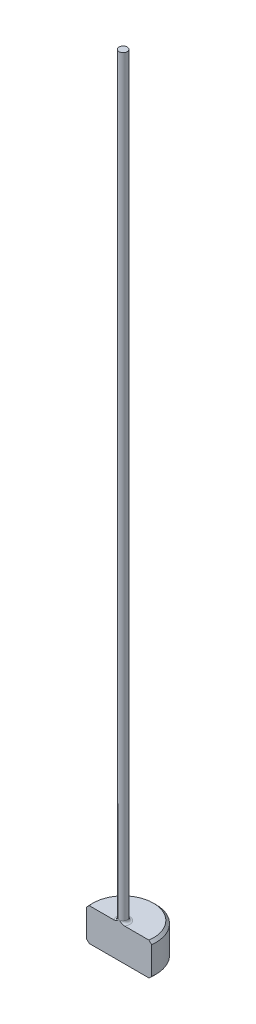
ISO-10303-21;
HEADER;
FILE_DESCRIPTION(('STEP AP214'),'2;1');
FILE_NAME('part.step','',(''),(''),'','','');
FILE_SCHEMA(('AUTOMOTIVE_DESIGN { 1 0 10303 214 1 1 1 1 }'));
ENDSEC;
DATA;
#1=APPLICATION_CONTEXT('core data for automotive mechanical design processes');
#2=APPLICATION_PROTOCOL_DEFINITION('international standard','automotive_design',2000,#1);
#3=PRODUCT_CONTEXT('',#1,'mechanical');
#4=PRODUCT('Part','Part','',(#3));
#5=PRODUCT_RELATED_PRODUCT_CATEGORY('part','',(#4));
#6=PRODUCT_DEFINITION_FORMATION('','',#4);
#7=PRODUCT_DEFINITION_CONTEXT('part definition',#1,'design');
#8=PRODUCT_DEFINITION('design','',#6,#7);
#9=PRODUCT_DEFINITION_SHAPE('','',#8);
#10=(LENGTH_UNIT() NAMED_UNIT(*) SI_UNIT(.MILLI.,.METRE.));
#11=(NAMED_UNIT(*) PLANE_ANGLE_UNIT() SI_UNIT($,.RADIAN.));
#12=(NAMED_UNIT(*) SI_UNIT($,.STERADIAN.) SOLID_ANGLE_UNIT());
#13=UNCERTAINTY_MEASURE_WITH_UNIT(LENGTH_MEASURE(1.E-05),#10,'distance_accuracy_value','');
#14=(GEOMETRIC_REPRESENTATION_CONTEXT(3) GLOBAL_UNCERTAINTY_ASSIGNED_CONTEXT((#13)) GLOBAL_UNIT_ASSIGNED_CONTEXT((#10,
#11,#12)) REPRESENTATION_CONTEXT('',''));
#15=CARTESIAN_POINT('',(0.,0.,0.));
#16=DIRECTION('',(0.,0.,1.));
#17=DIRECTION('',(1.,0.,0.));
#18=AXIS2_PLACEMENT_3D('',#15,#16,#17);
#19=CARTESIAN_POINT('',(0.,0.,0.));
#20=DIRECTION('',(0.,-1.,0.));
#21=DIRECTION('',(0.,0.,-1.));
#22=AXIS2_PLACEMENT_3D('',#19,#20,#21);
#23=PLANE('',#22);
#24=CARTESIAN_POINT('',(0.,0.,0.));
#25=DIRECTION('',(0.,-1.,0.));
#26=DIRECTION('',(0.,0.,-1.));
#27=AXIS2_PLACEMENT_3D('',#24,#25,#26);
#28=CIRCLE('',#27,2.92099999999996);
#29=CARTESIAN_POINT('',(-2.89399980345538,0.,0.396239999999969));
#30=VERTEX_POINT('',#29);
#31=CARTESIAN_POINT('',(2.89399980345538,0.,0.396239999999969));
#32=VERTEX_POINT('',#31);
#33=EDGE_CURVE('E100',#30,#32,#28,.T.);
#34=ORIENTED_EDGE('',*,*,#33,.T.);
#35=DIRECTION('',(-1.,0.,0.));
#36=VECTOR('',#35,1.);
#37=CARTESIAN_POINT('',(-3.15017759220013,0.,0.396239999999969));
#38=LINE('',#37,#36);
#39=EDGE_CURVE('E85',#32,#30,#38,.T.);
#40=ORIENTED_EDGE('',*,*,#39,.T.);
#41=EDGE_LOOP('',(#34,#40));
#42=FACE_BOUND('',#41,.T.);
#43=ADVANCED_FACE('F34',(#42),#23,.T.);
#44=CARTESIAN_POINT('',(0.,259.958771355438,0.));
#45=DIRECTION('',(0.,1.,0.));
#46=DIRECTION('',(0.,0.,1.));
#47=AXIS2_PLACEMENT_3D('',#44,#45,#46);
#48=CYLINDRICAL_SURFACE('',#47,3.17499999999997);
#49=CARTESIAN_POINT('',(0.,2.92099999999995,0.));
#50=DIRECTION('',(0.,1.,0.));
#51=DIRECTION('',(0.,0.,1.));
#52=AXIS2_PLACEMENT_3D('',#49,#50,#51);
#53=CIRCLE('',#52,3.17499999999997);
#54=CARTESIAN_POINT('',(-3.15017759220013,2.92099999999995,0.396239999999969));
#55=VERTEX_POINT('',#54);
#56=CARTESIAN_POINT('',(3.15017759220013,2.92099999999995,0.396239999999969));
#57=VERTEX_POINT('',#56);
#58=EDGE_CURVE('E106',#55,#57,#53,.F.);
#59=ORIENTED_EDGE('',*,*,#58,.T.);
#60=DIRECTION('',(0.,-1.,0.));
#61=VECTOR('',#60,1.);
#62=CARTESIAN_POINT('',(3.15017759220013,76.2,0.396239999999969));
#63=LINE('',#62,#61);
#64=CARTESIAN_POINT('',(3.15017759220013,0.254000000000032,0.396239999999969));
#65=VERTEX_POINT('',#64);
#66=EDGE_CURVE('E185',#57,#65,#63,.T.);
#67=ORIENTED_EDGE('',*,*,#66,.T.);
#68=CARTESIAN_POINT('',(0.,0.254000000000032,0.));
#69=DIRECTION('',(0.,-1.,0.));
#70=DIRECTION('',(0.,0.,-1.));
#71=AXIS2_PLACEMENT_3D('',#68,#69,#70);
#72=CIRCLE('',#71,3.17499999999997);
#73=CARTESIAN_POINT('',(-3.15017759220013,0.254000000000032,0.396239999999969));
#74=VERTEX_POINT('',#73);
#75=EDGE_CURVE('E102',#65,#74,#72,.F.);
#76=ORIENTED_EDGE('',*,*,#75,.T.);
#77=DIRECTION('',(0.,-1.,0.));
#78=VECTOR('',#77,1.);
#79=CARTESIAN_POINT('',(-3.15017759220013,76.2,0.396239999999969));
#80=LINE('',#79,#78);
#81=EDGE_CURVE('E95',#55,#74,#80,.T.);
#82=ORIENTED_EDGE('',*,*,#81,.F.);
#83=EDGE_LOOP('',(#59,#67,#76,#82));
#84=FACE_BOUND('',#83,.T.);
#85=ADVANCED_FACE('F160',(#84),#48,.T.);
#86=CARTESIAN_POINT('',(-3.17499999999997,3.175,0.));
#87=DIRECTION('',(0.,1.,0.));
#88=DIRECTION('',(0.,0.,1.));
#89=AXIS2_PLACEMENT_3D('',#86,#87,#88);
#90=PLANE('',#89);
#91=CARTESIAN_POINT('',(0.,3.175,0.));
#92=DIRECTION('',(0.,1.,0.));
#93=DIRECTION('',(0.,0.,1.));
#94=AXIS2_PLACEMENT_3D('',#91,#92,#93);
#95=CIRCLE('',#94,2.92099999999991);
#96=CARTESIAN_POINT('',(2.89399980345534,3.175,0.396239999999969));
#97=VERTEX_POINT('',#96);
#98=CARTESIAN_POINT('',(-2.89399980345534,3.175,0.396239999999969));
#99=VERTEX_POINT('',#98);
#100=EDGE_CURVE('E180',#97,#99,#95,.T.);
#101=ORIENTED_EDGE('',*,*,#100,.T.);
#102=DIRECTION('',(1.,0.,0.));
#103=VECTOR('',#102,1.);
#104=CARTESIAN_POINT('',(-3.17499999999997,3.175,0.396239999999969));
#105=LINE('',#104,#103);
#106=CARTESIAN_POINT('',(-0.515563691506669,3.17500000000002,0.396239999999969));
#107=VERTEX_POINT('',#106);
#108=EDGE_CURVE('E59',#99,#107,#105,.T.);
#109=ORIENTED_EDGE('',*,*,#108,.T.);
#110=CARTESIAN_POINT('',(0.,3.175,0.));
#111=DIRECTION('',(0.,1.,0.));
#112=DIRECTION('',(0.,0.,1.));
#113=AXIS2_PLACEMENT_3D('',#110,#111,#112);
#114=CIRCLE('',#113,0.650239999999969);
#115=CARTESIAN_POINT('',(0.515563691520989,3.17500000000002,0.396239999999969));
#116=VERTEX_POINT('',#115);
#117=EDGE_CURVE('E109',#107,#116,#114,.F.);
#118=ORIENTED_EDGE('',*,*,#117,.T.);
#119=EDGE_CURVE('E138',#116,#97,#105,.T.);
#120=ORIENTED_EDGE('',*,*,#119,.T.);
#121=EDGE_LOOP('',(#101,#109,#118,#120));
#122=FACE_BOUND('',#121,.T.);
#123=ADVANCED_FACE('F149',(#122),#90,.T.);
#124=CARTESIAN_POINT('',(0.,3.17499999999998,0.));
#125=DIRECTION('',(0.,-1.,0.));
#126=DIRECTION('',(0.,0.,-1.));
#127=AXIS2_PLACEMENT_3D('',#124,#125,#126);
#128=CONICAL_SURFACE('',#127,2.92099999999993,0.78539816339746);
#129=ORIENTED_EDGE('',*,*,#58,.F.);
#130=CARTESIAN_POINT('',(-6.93366147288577,-0.848974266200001,0.396239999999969));
#131=CARTESIAN_POINT('',(-6.69783963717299,-0.613539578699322,0.396239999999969));
#132=CARTESIAN_POINT('',(-6.46200107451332,-0.378121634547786,0.396239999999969));
#133=CARTESIAN_POINT('',(-5.99026657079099,0.0926621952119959,0.396239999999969));
#134=CARTESIAN_POINT('',(-5.7543706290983,0.328028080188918,0.396239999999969));
#135=CARTESIAN_POINT('',(-5.28244200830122,0.798744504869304,0.396239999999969));
#136=CARTESIAN_POINT('',(-5.04640930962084,1.03409502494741,0.396239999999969));
#137=CARTESIAN_POINT('',(-4.5742324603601,1.50467895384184,0.396239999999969));
#138=CARTESIAN_POINT('',(-4.33808831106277,1.73991236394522,0.396239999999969));
#139=CARTESIAN_POINT('',(-3.85746810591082,2.21830545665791,0.396239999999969));
#140=CARTESIAN_POINT('',(-3.61298561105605,2.46145867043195,0.396239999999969));
#141=CARTESIAN_POINT('',(-3.12367233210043,2.94743107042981,0.396239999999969));
#142=CARTESIAN_POINT('',(-2.87884153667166,3.19025024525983,0.396239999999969));
#143=CARTESIAN_POINT('',(-2.51107777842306,3.55391523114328,0.396239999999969));
#144=CARTESIAN_POINT('',(-2.38841380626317,3.67503289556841,0.396239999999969));
#145=CARTESIAN_POINT('',(-2.14279703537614,3.91697838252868,0.396239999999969));
#146=CARTESIAN_POINT('',(-2.01984423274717,4.0378062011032,0.396239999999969));
#147=CARTESIAN_POINT('',(-1.77347700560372,4.27897631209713,0.396239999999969));
#148=CARTESIAN_POINT('',(-1.65006261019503,4.39931863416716,0.396239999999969));
#149=CARTESIAN_POINT('',(-1.46427278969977,4.57913941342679,0.396239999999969));
#150=CARTESIAN_POINT('',(-1.40223216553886,4.6389635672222,0.396239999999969));
#151=CARTESIAN_POINT('',(-1.27782307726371,4.75826977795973,0.396239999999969));
#152=CARTESIAN_POINT('',(-1.2154546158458,4.81775183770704,0.396239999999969));
#153=CARTESIAN_POINT('',(-1.11914794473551,4.90882686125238,0.396239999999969));
#154=CARTESIAN_POINT('',(-1.08538772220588,4.94060795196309,0.396239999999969));
#155=CARTESIAN_POINT('',(-1.017677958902,5.00396912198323,0.396239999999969));
#156=CARTESIAN_POINT('',(-0.983728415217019,5.03554919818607,0.396239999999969));
#157=CARTESIAN_POINT('',(-0.915697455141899,5.09833438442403,0.396239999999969));
#158=CARTESIAN_POINT('',(-0.881616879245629,5.12954040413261,0.396239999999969));
#159=CARTESIAN_POINT('',(-0.813124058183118,5.19158509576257,0.396239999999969));
#160=CARTESIAN_POINT('',(-0.778711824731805,5.22242378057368,0.396239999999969));
#161=CARTESIAN_POINT('',(-0.697678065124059,5.29395106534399,0.396239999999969));
#162=CARTESIAN_POINT('',(-0.650874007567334,5.33443305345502,0.396239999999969));
#163=CARTESIAN_POINT('',(-0.55562841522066,5.41407382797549,0.396239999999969));
#164=CARTESIAN_POINT('',(-0.507178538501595,5.45322287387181,0.396239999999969));
#165=CARTESIAN_POINT('',(-0.432351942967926,5.50976570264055,0.396239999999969));
#166=CARTESIAN_POINT('',(-0.406887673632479,5.52835735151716,0.396239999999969));
#167=CARTESIAN_POINT('',(-0.355035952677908,5.56430095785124,0.396239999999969));
#168=CARTESIAN_POINT('',(-0.328647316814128,5.58165123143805,0.396239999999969));
#169=CARTESIAN_POINT('',(-0.274881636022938,5.61422039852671,0.396239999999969));
#170=CARTESIAN_POINT('',(-0.247515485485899,5.62945689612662,0.396239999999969));
#171=CARTESIAN_POINT('',(-0.191255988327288,5.65670374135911,0.396239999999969));
#172=CARTESIAN_POINT('',(-0.162367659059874,5.66872398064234,0.396239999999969));
#173=CARTESIAN_POINT('',(-0.105452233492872,5.68676866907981,0.396239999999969));
#174=CARTESIAN_POINT('',(-0.0775716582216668,5.6932263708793,0.396239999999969));
#175=CARTESIAN_POINT('',(-0.0211829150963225,5.7001642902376,0.396239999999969));
#176=CARTESIAN_POINT('',(0.0073204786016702,5.70068017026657,0.396239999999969));
#177=CARTESIAN_POINT('',(0.0636445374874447,5.69566875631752,0.396239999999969));
#178=CARTESIAN_POINT('',(0.0914673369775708,5.69016379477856,0.396239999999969));
#179=CARTESIAN_POINT('',(0.132245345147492,5.67848253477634,0.396239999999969));
#180=CARTESIAN_POINT('',(0.145732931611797,5.67399212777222,0.396239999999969));
#181=CARTESIAN_POINT('',(0.172358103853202,5.66407201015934,0.396239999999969));
#182=CARTESIAN_POINT('',(0.185495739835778,5.65864243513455,0.396239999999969));
#183=CARTESIAN_POINT('',(0.220905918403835,5.64278853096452,0.396239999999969));
#184=CARTESIAN_POINT('',(0.242839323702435,5.6316133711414,0.396239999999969));
#185=CARTESIAN_POINT('',(0.285864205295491,5.60773140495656,0.396239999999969));
#186=CARTESIAN_POINT('',(0.306954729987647,5.59502292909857,0.396239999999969));
#187=CARTESIAN_POINT('',(0.369366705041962,5.55526586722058,0.396239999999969));
#188=CARTESIAN_POINT('',(0.40968490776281,5.52665822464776,0.396239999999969));
#189=CARTESIAN_POINT('',(0.489078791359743,5.46709265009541,0.396239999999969));
#190=CARTESIAN_POINT('',(0.528139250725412,5.43611517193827,0.396239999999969));
#191=CARTESIAN_POINT('',(0.605156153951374,5.37299545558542,0.396239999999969));
#192=CARTESIAN_POINT('',(0.643114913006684,5.34085603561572,0.396239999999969));
#193=CARTESIAN_POINT('',(0.71757572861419,5.27650009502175,0.396239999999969));
#194=CARTESIAN_POINT('',(0.754091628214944,5.24429944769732,0.396239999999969));
#195=CARTESIAN_POINT('',(0.826682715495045,5.17940417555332,0.396239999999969));
#196=CARTESIAN_POINT('',(0.862757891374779,5.14670953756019,0.396239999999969));
#197=CARTESIAN_POINT('',(0.970527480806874,5.04810769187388,0.396239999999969));
#198=CARTESIAN_POINT('',(1.04175542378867,4.98169182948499,0.396239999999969));
#199=CARTESIAN_POINT('',(1.18360536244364,4.84805178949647,0.396239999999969));
#200=CARTESIAN_POINT('',(1.25422653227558,4.78082674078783,0.396239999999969));
#201=CARTESIAN_POINT('',(1.39502855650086,4.64592877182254,0.396239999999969));
#202=CARTESIAN_POINT('',(1.46520944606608,4.57825588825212,0.396239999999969));
#203=CARTESIAN_POINT('',(1.67392041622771,4.37617581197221,0.396239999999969));
#204=CARTESIAN_POINT('',(1.8120441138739,4.24134952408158,0.396239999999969));
#205=CARTESIAN_POINT('',(2.08768598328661,3.97121341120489,0.396239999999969));
#206=CARTESIAN_POINT('',(2.22520441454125,3.83590385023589,0.396239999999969));
#207=CARTESIAN_POINT('',(2.55207972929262,3.51353631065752,0.396239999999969));
#208=CARTESIAN_POINT('',(2.74129548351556,3.32633525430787,0.396239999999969));
#209=CARTESIAN_POINT('',(3.11941516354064,2.95161758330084,0.396239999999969));
#210=CARTESIAN_POINT('',(3.30831908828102,2.76410096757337,0.396239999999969));
#211=CARTESIAN_POINT('',(3.87483613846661,2.20119548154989,0.396239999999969));
#212=CARTESIAN_POINT('',(4.25217453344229,1.82553015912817,0.396239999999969));
#213=CARTESIAN_POINT('',(5.01368273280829,1.06678506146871,0.396239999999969));
#214=CARTESIAN_POINT('',(5.39784673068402,0.683699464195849,0.396239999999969));
#215=CARTESIAN_POINT('',(6.16590360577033,-0.0825728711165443,0.396239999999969));
#216=CARTESIAN_POINT('',(6.54979652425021,-0.465759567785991,0.396239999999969));
#217=CARTESIAN_POINT('',(6.93366147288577,-0.848974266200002,0.396239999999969));
#218=B_SPLINE_CURVE_WITH_KNOTS('',3,(#130,#131,#132,#133,#134,#135,#136,#137,#138,#139,#140,
#141,#142,#143,#144,#145,#146,#147,#148,#149,#150,#151,#152,#153,#154,#155,#156,#157,#158,#159,
#160,#161,#162,#163,#164,#165,#166,#167,#168,#169,#170,#171,#172,#173,#174,#175,#176,#177,#178,
#179,#180,#181,#182,#183,#184,#185,#186,#187,#188,#189,#190,#191,#192,#193,#194,#195,#196,#197,
#198,#199,#200,#201,#202,#203,#204,#205,#206,#207,#208,#209,#210,#211,#212,#213,#214,#215,#216,
#217),.UNSPECIFIED.,.F.,.F.,(4,2,2,2,2,2,2,2,2,2,2,2,2,2,2,2,2,2,2,2,2,2,2,2,2,2,2,2,2,2,2,2,2,
2,2,2,2,2,2,2,2,2,2,4),(0.,0.999686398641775,1.99938432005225,2.99934015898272,3.99928475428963,
5.03372005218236,6.06818979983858,6.5853387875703,7.1024948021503,7.61961873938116,
7.87817501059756,8.13672915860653,8.27582606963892,8.41492512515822,8.55355137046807,
8.69217273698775,8.87780830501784,9.0645928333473,9.15915597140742,9.25384503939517,
9.34769090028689,9.44124472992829,9.52659694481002,9.61143661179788,9.69596265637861,
9.7385830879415,9.78119737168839,9.85494794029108,9.92877954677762,10.0769229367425,
10.2264573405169,10.3756506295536,10.5217024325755,10.6677581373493,10.9599116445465,
11.2524142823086,11.5448932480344,12.1239460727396,12.702720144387,13.5012312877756,
14.299745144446,15.8971105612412,17.5246943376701,19.1519165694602),.UNSPECIFIED.);
#219=EDGE_CURVE('E137',#55,#99,#218,.T.);
#220=ORIENTED_EDGE('',*,*,#219,.T.);
#221=ORIENTED_EDGE('',*,*,#100,.F.);
#222=EDGE_CURVE('E129',#97,#57,#218,.T.);
#223=ORIENTED_EDGE('',*,*,#222,.T.);
#224=EDGE_LOOP('',(#129,#220,#221,#223));
#225=FACE_BOUND('',#224,.T.);
#226=ADVANCED_FACE('F145',(#225),#128,.T.);
#227=CARTESIAN_POINT('',(0.,0.254000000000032,0.));
#228=DIRECTION('',(0.,1.,0.));
#229=DIRECTION('',(0.,0.,1.));
#230=AXIS2_PLACEMENT_3D('',#227,#228,#229);
#231=CONICAL_SURFACE('',#230,3.17499999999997,0.785398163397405);
#232=ORIENTED_EDGE('',*,*,#75,.F.);
#233=CARTESIAN_POINT('',(6.93366147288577,4.0239742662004,0.396239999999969));
#234=CARTESIAN_POINT('',(6.69783963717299,3.7885395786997,0.396239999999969));
#235=CARTESIAN_POINT('',(6.46200107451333,3.55312163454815,0.396239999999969));
#236=CARTESIAN_POINT('',(5.99026657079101,3.08233780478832,0.396239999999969));
#237=CARTESIAN_POINT('',(5.75437062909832,2.84697191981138,0.396239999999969));
#238=CARTESIAN_POINT('',(5.28244200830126,2.37625549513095,0.396239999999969));
#239=CARTESIAN_POINT('',(5.04640930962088,2.14090497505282,0.396239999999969));
#240=CARTESIAN_POINT('',(4.57423246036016,1.67032104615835,0.396239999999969));
#241=CARTESIAN_POINT('',(4.33808831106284,1.43508763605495,0.396239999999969));
#242=CARTESIAN_POINT('',(3.8574681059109,0.956694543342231,0.396239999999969));
#243=CARTESIAN_POINT('',(3.61298561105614,0.713541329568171,0.396239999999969));
#244=CARTESIAN_POINT('',(3.12367233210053,0.22756892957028,0.396239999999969));
#245=CARTESIAN_POINT('',(2.87884153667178,-0.0152502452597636,0.396239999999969));
#246=CARTESIAN_POINT('',(2.51107777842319,-0.37891523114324,0.396239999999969));
#247=CARTESIAN_POINT('',(2.3884138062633,-0.500032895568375,0.396239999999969));
#248=CARTESIAN_POINT('',(2.14279703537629,-0.741978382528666,0.396239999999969));
#249=CARTESIAN_POINT('',(2.01984423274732,-0.862806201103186,0.396239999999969));
#250=CARTESIAN_POINT('',(1.77347700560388,-1.10397631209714,0.396239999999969));
#251=CARTESIAN_POINT('',(1.6500626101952,-1.22431863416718,0.396239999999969));
#252=CARTESIAN_POINT('',(1.46427278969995,-1.40413941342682,0.396239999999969));
#253=CARTESIAN_POINT('',(1.40223216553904,-1.46396356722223,0.396239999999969));
#254=CARTESIAN_POINT('',(1.27782307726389,-1.58326977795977,0.396239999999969));
#255=CARTESIAN_POINT('',(1.21545461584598,-1.64275183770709,0.396239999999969));
#256=CARTESIAN_POINT('',(1.11914794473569,-1.73382686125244,0.396239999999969));
#257=CARTESIAN_POINT('',(1.08538772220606,-1.76560795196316,0.396239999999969));
#258=CARTESIAN_POINT('',(1.01767795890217,-1.82896912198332,0.396239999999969));
#259=CARTESIAN_POINT('',(0.983728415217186,-1.86054919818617,0.396239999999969));
#260=CARTESIAN_POINT('',(0.915697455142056,-1.92333438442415,0.396239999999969));
#261=CARTESIAN_POINT('',(0.881616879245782,-1.95454040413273,0.396239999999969));
#262=CARTESIAN_POINT('',(0.813124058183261,-2.01658509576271,0.396239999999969));
#263=CARTESIAN_POINT('',(0.778711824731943,-2.04742378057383,0.396239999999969));
#264=CARTESIAN_POINT('',(0.697678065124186,-2.11895106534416,0.396239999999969));
#265=CARTESIAN_POINT('',(0.650874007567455,-2.1594330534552,0.396239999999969));
#266=CARTESIAN_POINT('',(0.55562841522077,-2.2390738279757,0.396239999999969));
#267=CARTESIAN_POINT('',(0.507178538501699,-2.27822287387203,0.396239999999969));
#268=CARTESIAN_POINT('',(0.432351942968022,-2.33476570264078,0.396239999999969));
#269=CARTESIAN_POINT('',(0.406887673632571,-2.3533573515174,0.396239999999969));
#270=CARTESIAN_POINT('',(0.355035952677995,-2.38930095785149,0.396239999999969));
#271=CARTESIAN_POINT('',(0.328647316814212,-2.40665123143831,0.396239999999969));
#272=CARTESIAN_POINT('',(0.274881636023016,-2.43922039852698,0.396239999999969));
#273=CARTESIAN_POINT('',(0.247515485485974,-2.45445689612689,0.396239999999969));
#274=CARTESIAN_POINT('',(0.191255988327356,-2.4817037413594,0.396239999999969));
#275=CARTESIAN_POINT('',(0.162367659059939,-2.49372398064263,0.396239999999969));
#276=CARTESIAN_POINT('',(0.105452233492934,-2.51176866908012,0.396239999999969));
#277=CARTESIAN_POINT('',(0.0775716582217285,-2.51822637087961,0.396239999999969));
#278=CARTESIAN_POINT('',(0.0211829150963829,-2.52516429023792,0.396239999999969));
#279=CARTESIAN_POINT('',(-0.00732047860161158,-2.5256801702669,0.396239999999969));
#280=CARTESIAN_POINT('',(-0.0636445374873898,-2.52066875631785,0.396239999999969));
#281=CARTESIAN_POINT('',(-0.0914673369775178,-2.51516379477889,0.396239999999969));
#282=CARTESIAN_POINT('',(-0.132245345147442,-2.50348253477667,0.396239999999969));
#283=CARTESIAN_POINT('',(-0.145732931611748,-2.49899212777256,0.396239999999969));
#284=CARTESIAN_POINT('',(-0.172358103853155,-2.48907201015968,0.396239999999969));
#285=CARTESIAN_POINT('',(-0.185495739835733,-2.48364243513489,0.396239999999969));
#286=CARTESIAN_POINT('',(-0.220905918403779,-2.46778853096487,0.396239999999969));
#287=CARTESIAN_POINT('',(-0.242839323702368,-2.45661337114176,0.396239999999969));
#288=CARTESIAN_POINT('',(-0.285864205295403,-2.43273140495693,0.396239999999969));
#289=CARTESIAN_POINT('',(-0.306954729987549,-2.42002292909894,0.396239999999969));
#290=CARTESIAN_POINT('',(-0.369366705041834,-2.38026586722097,0.396239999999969));
#291=CARTESIAN_POINT('',(-0.409684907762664,-2.35165822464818,0.396239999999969));
#292=CARTESIAN_POINT('',(-0.489078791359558,-2.29209265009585,0.396239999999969));
#293=CARTESIAN_POINT('',(-0.528139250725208,-2.26111517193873,0.396239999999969));
#294=CARTESIAN_POINT('',(-0.605156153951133,-2.19799545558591,0.396239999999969));
#295=CARTESIAN_POINT('',(-0.643114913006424,-2.16585603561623,0.396239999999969));
#296=CARTESIAN_POINT('',(-0.717575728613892,-2.10150009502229,0.396239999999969));
#297=CARTESIAN_POINT('',(-0.754091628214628,-2.06929944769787,0.396239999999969));
#298=CARTESIAN_POINT('',(-0.826682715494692,-2.0044041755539,0.396239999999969));
#299=CARTESIAN_POINT('',(-0.862757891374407,-1.97170953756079,0.396239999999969));
#300=CARTESIAN_POINT('',(-0.970527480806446,-1.87310769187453,0.396239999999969));
#301=CARTESIAN_POINT('',(-1.0417554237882,-1.80669182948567,0.396239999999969));
#302=CARTESIAN_POINT('',(-1.1836053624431,-1.67305178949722,0.396239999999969));
#303=CARTESIAN_POINT('',(-1.254226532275,-1.60582674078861,0.396239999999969));
#304=CARTESIAN_POINT('',(-1.3950285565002,-1.47092877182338,0.396239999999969));
#305=CARTESIAN_POINT('',(-1.46520944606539,-1.40325588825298,0.396239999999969));
#306=CARTESIAN_POINT('',(-1.67392041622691,-1.20117581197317,0.396239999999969));
#307=CARTESIAN_POINT('',(-1.81204411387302,-1.0663495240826,0.396239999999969));
#308=CARTESIAN_POINT('',(-2.08768598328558,-0.796213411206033,0.396239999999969));
#309=CARTESIAN_POINT('',(-2.22520441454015,-0.660903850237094,0.396239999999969));
#310=CARTESIAN_POINT('',(-2.55207972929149,-0.338536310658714,0.396239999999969));
#311=CARTESIAN_POINT('',(-2.74129548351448,-0.151335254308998,0.396239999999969));
#312=CARTESIAN_POINT('',(-3.11941516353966,0.223382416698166,0.396239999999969));
#313=CARTESIAN_POINT('',(-3.30831908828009,0.410899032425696,0.396239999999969));
#314=CARTESIAN_POINT('',(-3.87483613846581,0.973804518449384,0.396239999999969));
#315=CARTESIAN_POINT('',(-4.2521745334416,1.34946984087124,0.396239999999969));
#316=CARTESIAN_POINT('',(-5.01368273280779,2.10821493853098,0.396239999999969));
#317=CARTESIAN_POINT('',(-5.39784673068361,2.49130053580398,0.396239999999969));
#318=CARTESIAN_POINT('',(-6.16590360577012,3.25757287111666,0.396239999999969));
#319=CARTESIAN_POINT('',(-6.54979652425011,3.64075956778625,0.396239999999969));
#320=CARTESIAN_POINT('',(-6.93366147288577,4.0239742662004,0.396239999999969));
#321=B_SPLINE_CURVE_WITH_KNOTS('',3,(#233,#234,#235,#236,#237,#238,#239,#240,#241,#242,#243,
#244,#245,#246,#247,#248,#249,#250,#251,#252,#253,#254,#255,#256,#257,#258,#259,#260,#261,#262,
#263,#264,#265,#266,#267,#268,#269,#270,#271,#272,#273,#274,#275,#276,#277,#278,#279,#280,#281,
#282,#283,#284,#285,#286,#287,#288,#289,#290,#291,#292,#293,#294,#295,#296,#297,#298,#299,#300,
#301,#302,#303,#304,#305,#306,#307,#308,#309,#310,#311,#312,#313,#314,#315,#316,#317,#318,#319,
#320),.UNSPECIFIED.,.F.,.F.,(4,2,2,2,2,2,2,2,2,2,2,2,2,2,2,2,2,2,2,2,2,2,2,2,2,2,2,2,2,2,2,2,2,
2,2,2,2,2,2,2,2,2,2,4),(0.,0.999686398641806,1.99938432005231,2.99934015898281,3.99928475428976,
5.03372005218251,6.06818979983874,6.58533878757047,7.10249480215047,7.61961873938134,
7.87817501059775,8.13672915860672,8.27582606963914,8.41492512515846,8.55355137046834,
8.69217273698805,8.87780830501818,9.06459283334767,9.15915597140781,9.25384503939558,
9.34769090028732,9.44124472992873,9.52659694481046,9.61143661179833,9.69596265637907,
9.73858308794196,9.78119737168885,9.8549479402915,9.92877954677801,10.0769229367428,
10.2264573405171,10.3756506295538,10.5217024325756,10.6677581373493,10.9599116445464,
11.2524142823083,11.5448932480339,12.1239460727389,12.702720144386,13.5012312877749,
14.2997451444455,15.8971105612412,17.5246943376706,19.1519165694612),.UNSPECIFIED.);
#322=EDGE_CURVE('E88',#65,#32,#321,.T.);
#323=ORIENTED_EDGE('',*,*,#322,.T.);
#324=ORIENTED_EDGE('',*,*,#33,.F.);
#325=EDGE_CURVE('E91',#30,#74,#321,.T.);
#326=ORIENTED_EDGE('',*,*,#325,.T.);
#327=EDGE_LOOP('',(#232,#323,#324,#326));
#328=FACE_BOUND('',#327,.T.);
#329=ADVANCED_FACE('F99',(#328),#231,.T.);
#330=CARTESIAN_POINT('',(0.,3.42900000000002,0.));
#331=DIRECTION('',(0.,1.,0.));
#332=DIRECTION('',(0.,0.,1.));
#333=AXIS2_PLACEMENT_3D('',#330,#331,#332);
#334=TOROIDAL_SURFACE('',#333,0.650239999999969,0.254);
#335=CARTESIAN_POINT('',(0.,3.42900000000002,0.396239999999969));
#336=CARTESIAN_POINT('',(2.93176739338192E-10,3.42900063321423,0.396239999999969));
#337=CARTESIAN_POINT('',(5.59531001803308E-08,3.42900126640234,0.396239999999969));
#338=CARTESIAN_POINT('',(2.559816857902E-07,3.42900251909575,0.396239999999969));
#339=CARTESIAN_POINT('',(4.00595841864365E-07,3.42900313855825,0.396239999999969));
#340=CARTESIAN_POINT('',(9.4443044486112E-07,3.42900498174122,0.396239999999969));
#341=CARTESIAN_POINT('',(1.45261094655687E-06,3.42900617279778,0.396239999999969));
#342=CARTESIAN_POINT('',(2.68050052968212E-06,3.42900853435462,0.396239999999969));
#343=CARTESIAN_POINT('',(3.41192741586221E-06,3.4290096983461,0.396239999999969));
#344=CARTESIAN_POINT('',(5.00593807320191E-06,3.42901192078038,0.396239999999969));
#345=CARTESIAN_POINT('',(5.86781951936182E-06,3.42901297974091,0.396239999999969));
#346=CARTESIAN_POINT('',(8.90587654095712E-06,3.42901645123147,0.396239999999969));
#347=CARTESIAN_POINT('',(1.12536810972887E-05,3.42901871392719,0.396239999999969));
#348=CARTESIAN_POINT('',(1.61531122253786E-05,3.42902284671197,0.396239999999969));
#349=CARTESIAN_POINT('',(1.8697708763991E-05,3.4290247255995,0.396239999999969));
#350=CARTESIAN_POINT('',(2.83774516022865E-05,3.42903162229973,0.396239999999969));
#351=CARTESIAN_POINT('',(3.57138525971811E-05,3.42903634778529,0.396239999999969));
#352=CARTESIAN_POINT('',(5.008572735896E-05,3.42904489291,0.396239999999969));
#353=CARTESIAN_POINT('',(5.70953794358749E-05,3.42904875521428,0.396239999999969));
#354=CARTESIAN_POINT('',(0.00010185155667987,3.42907557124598,0.396239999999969));
#355=CARTESIAN_POINT('',(0.000134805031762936,3.42910566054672,0.396239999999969));
#356=CARTESIAN_POINT('',(0.000255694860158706,3.42921068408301,0.396239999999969));
#357=CARTESIAN_POINT('',(0.00034714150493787,3.42928023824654,0.396239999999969));
#358=CARTESIAN_POINT('',(0.000675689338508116,3.42953512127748,0.396239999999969));
#359=CARTESIAN_POINT('',(0.000909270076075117,3.42972583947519,0.396239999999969));
#360=CARTESIAN_POINT('',(0.00179532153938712,3.43044426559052,0.396239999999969));
#361=CARTESIAN_POINT('',(0.00245163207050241,3.43096612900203,0.396239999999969));
#362=CARTESIAN_POINT('',(0.0146066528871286,3.44063677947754,0.396239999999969));
#363=CARTESIAN_POINT('',(0.0260655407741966,3.44984678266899,0.396239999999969));
#364=CARTESIAN_POINT('',(0.0487964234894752,3.46791975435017,0.396239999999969));
#365=CARTESIAN_POINT('',(0.0600661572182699,3.47678570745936,0.396239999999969));
#366=CARTESIAN_POINT('',(0.0836206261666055,3.49505865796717,0.396239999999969));
#367=CARTESIAN_POINT('',(0.0959152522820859,3.50445311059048,0.396239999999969));
#368=CARTESIAN_POINT('',(0.120807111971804,3.52301212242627,0.396239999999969));
#369=CARTESIAN_POINT('',(0.133405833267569,3.53217468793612,0.396239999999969));
#370=CARTESIAN_POINT('',(0.166801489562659,3.55566155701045,0.396239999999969));
#371=CARTESIAN_POINT('',(0.187832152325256,3.56965885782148,0.396239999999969));
#372=CARTESIAN_POINT('',(0.230520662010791,3.59585162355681,0.396239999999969));
#373=CARTESIAN_POINT('',(0.252161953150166,3.60807349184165,0.396239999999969));
#374=CARTESIAN_POINT('',(0.286045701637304,3.6251365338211,0.396239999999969));
#375=CARTESIAN_POINT('',(0.297904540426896,3.630739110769,0.396239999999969));
#376=CARTESIAN_POINT('',(0.321963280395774,3.64127934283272,0.396239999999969));
#377=CARTESIAN_POINT('',(0.334164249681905,3.64621454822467,0.396239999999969));
#378=CARTESIAN_POINT('',(0.372237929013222,3.66021208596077,0.396239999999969));
#379=CARTESIAN_POINT('',(0.398620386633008,3.66796266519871,0.396239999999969));
#380=CARTESIAN_POINT('',(0.452312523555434,3.67902517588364,0.396239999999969));
#381=CARTESIAN_POINT('',(0.47962134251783,3.68234111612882,0.396239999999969));
#382=CARTESIAN_POINT('',(0.534051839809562,3.68347169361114,0.396239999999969));
#383=CARTESIAN_POINT('',(0.561170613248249,3.68136429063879,0.396239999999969));
#384=CARTESIAN_POINT('',(0.604511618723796,3.67285763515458,0.396239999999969));
#385=CARTESIAN_POINT('',(0.621101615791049,3.66830341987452,0.396239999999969));
#386=CARTESIAN_POINT('',(0.653374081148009,3.65654517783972,0.396239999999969));
#387=CARTESIAN_POINT('',(0.66905463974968,3.64933579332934,0.396239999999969));
#388=CARTESIAN_POINT('',(0.698994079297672,3.63218379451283,0.396239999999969));
#389=CARTESIAN_POINT('',(0.713243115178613,3.62222381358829,0.396239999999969));
#390=CARTESIAN_POINT('',(0.739544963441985,3.599736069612,0.396239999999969));
#391=CARTESIAN_POINT('',(0.751600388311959,3.5872113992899,0.396239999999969));
#392=CARTESIAN_POINT('',(0.771546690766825,3.56165038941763,0.396239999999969));
#393=CARTESIAN_POINT('',(0.779769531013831,3.54887294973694,0.396239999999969));
#394=CARTESIAN_POINT('',(0.793655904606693,3.52199450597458,0.396239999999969));
#395=CARTESIAN_POINT('',(0.79932118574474,3.50789441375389,0.396239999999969));
#396=CARTESIAN_POINT('',(0.807354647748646,3.48040106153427,0.396239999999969));
#397=CARTESIAN_POINT('',(0.810007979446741,3.46709056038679,0.396239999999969));
#398=CARTESIAN_POINT('',(0.812923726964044,3.44021163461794,0.396239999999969));
#399=CARTESIAN_POINT('',(0.813187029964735,3.42664330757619,0.396239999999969));
#400=CARTESIAN_POINT('',(0.811355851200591,3.40029497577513,0.396239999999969));
#401=CARTESIAN_POINT('',(0.809368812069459,3.38750732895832,0.396239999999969));
#402=CARTESIAN_POINT('',(0.803290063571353,3.36244456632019,0.396239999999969));
#403=CARTESIAN_POINT('',(0.799198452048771,3.35016942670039,0.396239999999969));
#404=CARTESIAN_POINT('',(0.789030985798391,3.32636730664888,0.396239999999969));
#405=CARTESIAN_POINT('',(0.782940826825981,3.31484645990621,0.396239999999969));
#406=CARTESIAN_POINT('',(0.76900734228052,3.29292164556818,0.396239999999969));
#407=CARTESIAN_POINT('',(0.761163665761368,3.28251790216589,0.396239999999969));
#408=CARTESIAN_POINT('',(0.743514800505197,3.26249857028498,0.396239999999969));
#409=CARTESIAN_POINT('',(0.733625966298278,3.25295690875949,0.396239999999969));
#410=CARTESIAN_POINT('',(0.712515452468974,3.23549416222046,0.396239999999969));
#411=CARTESIAN_POINT('',(0.701293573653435,3.22757331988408,0.396239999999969));
#412=CARTESIAN_POINT('',(0.676675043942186,3.21272310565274,0.396239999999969));
#413=CARTESIAN_POINT('',(0.663173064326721,3.20596883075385,0.396239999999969));
#414=CARTESIAN_POINT('',(0.635322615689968,3.19449747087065,0.396239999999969));
#415=CARTESIAN_POINT('',(0.620973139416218,3.18978286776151,0.396239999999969));
#416=CARTESIAN_POINT('',(0.589632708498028,3.18177951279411,0.396239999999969));
#417=CARTESIAN_POINT('',(0.572562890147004,3.1788010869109,0.396239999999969));
#418=CARTESIAN_POINT('',(0.538239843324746,3.1752512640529,0.396239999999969));
#419=CARTESIAN_POINT('',(0.520987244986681,3.17467329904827,0.396239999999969));
#420=CARTESIAN_POINT('',(0.477205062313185,3.1759381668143,0.396239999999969));
#421=CARTESIAN_POINT('',(0.450716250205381,3.17926308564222,0.396239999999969));
#422=CARTESIAN_POINT('',(0.398208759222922,3.19016478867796,0.396239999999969));
#423=CARTESIAN_POINT('',(0.372206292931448,3.19781458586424,0.396239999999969));
#424=CARTESIAN_POINT('',(0.32542141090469,3.21498716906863,0.396239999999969));
#425=CARTESIAN_POINT('',(0.304457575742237,3.22403143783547,0.396239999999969));
#426=CARTESIAN_POINT('',(0.263391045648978,3.24399776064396,0.396239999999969));
#427=CARTESIAN_POINT('',(0.243290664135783,3.25492450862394,0.396239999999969));
#428=CARTESIAN_POINT('',(0.205112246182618,3.27747757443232,0.396239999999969));
#429=CARTESIAN_POINT('',(0.186985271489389,3.28902237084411,0.396239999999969));
#430=CARTESIAN_POINT('',(0.151456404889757,3.31293720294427,0.396239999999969));
#431=CARTESIAN_POINT('',(0.134050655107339,3.32530156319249,0.396239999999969));
#432=CARTESIAN_POINT('',(0.108182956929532,3.34436153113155,0.396239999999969));
#433=CARTESIAN_POINT('',(0.0995556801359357,3.35083596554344,0.396239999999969));
#434=CARTESIAN_POINT('',(0.08223938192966,3.36402006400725,0.396239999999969));
#435=CARTESIAN_POINT('',(0.0735519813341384,3.3707318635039,0.396239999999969));
#436=CARTESIAN_POINT('',(0.0541902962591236,3.38583414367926,0.396239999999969));
#437=CARTESIAN_POINT('',(0.0435327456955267,3.3942457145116,0.396239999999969));
#438=CARTESIAN_POINT('',(0.0229672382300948,3.41063042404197,0.396239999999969));
#439=CARTESIAN_POINT('',(0.0130546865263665,3.41859745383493,0.396239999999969));
#440=CARTESIAN_POINT('',(0.00245287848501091,3.42703291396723,0.396239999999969));
#441=CARTESIAN_POINT('',(0.00179779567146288,3.42755379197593,0.396239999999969));
#442=CARTESIAN_POINT('',(0.000912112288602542,3.42827189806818,0.396239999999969));
#443=CARTESIAN_POINT('',(0.000677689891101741,3.4284633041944,0.396239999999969));
#444=CARTESIAN_POINT('',(0.00034799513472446,3.42871906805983,0.396239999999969));
#445=CARTESIAN_POINT('',(0.000256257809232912,3.42878884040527,0.396239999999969));
#446=CARTESIAN_POINT('',(0.000135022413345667,3.42889417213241,0.396239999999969));
#447=CARTESIAN_POINT('',(0.000101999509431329,3.42892432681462,0.396239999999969));
#448=CARTESIAN_POINT('',(5.71490599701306E-05,3.42895118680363,0.396239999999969));
#449=CARTESIAN_POINT('',(5.01298553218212E-05,3.42895505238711,0.396239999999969));
#450=CARTESIAN_POINT('',(3.57387496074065E-05,3.42896360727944,0.396239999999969));
#451=CARTESIAN_POINT('',(2.83928272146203E-05,3.42896833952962,0.396239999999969));
#452=CARTESIAN_POINT('',(1.87022799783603E-05,3.42897524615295,0.396239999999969));
#453=CARTESIAN_POINT('',(1.61556534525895E-05,3.42897712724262,0.396239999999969));
#454=CARTESIAN_POINT('',(1.12526946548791E-05,3.42898126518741,0.396239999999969));
#455=CARTESIAN_POINT('',(8.9034160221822E-06,3.42898353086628,0.396239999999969));
#456=CARTESIAN_POINT('',(5.86406579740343E-06,3.42898700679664,0.396239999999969));
#457=CARTESIAN_POINT('',(5.00196631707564E-06,3.4289880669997,0.396239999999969));
#458=CARTESIAN_POINT('',(3.4077749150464E-06,3.42899029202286,0.396239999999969));
#459=CARTESIAN_POINT('',(2.67638739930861E-06,3.4289914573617,0.396239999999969));
#460=CARTESIAN_POINT('',(1.44895608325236E-06,3.42899382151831,0.396239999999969));
#461=CARTESIAN_POINT('',(9.41163735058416E-07,3.42899501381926,0.396239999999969));
#462=CARTESIAN_POINT('',(3.98264422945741E-07,3.42899685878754,0.396239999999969));
#463=CARTESIAN_POINT('',(2.54017523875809E-07,3.42899747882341,0.396239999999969));
#464=CARTESIAN_POINT('',(5.48617781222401E-08,3.42899873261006,0.396239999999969));
#465=CARTESIAN_POINT('',(-2.93393279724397E-10,3.42899936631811,0.396239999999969));
#466=CARTESIAN_POINT('',(0.,3.42900000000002,0.396239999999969));
#467=B_SPLINE_CURVE_WITH_KNOTS('',3,(#335,#336,#337,#338,#339,#340,#341,#342,#343,#344,#345,
#346,#347,#348,#349,#350,#351,#352,#353,#354,#355,#356,#357,#358,#359,#360,#361,#362,#363,#364,
#365,#366,#367,#368,#369,#370,#371,#372,#373,#374,#375,#376,#377,#378,#379,#380,#381,#382,#383,
#384,#385,#386,#387,#388,#389,#390,#391,#392,#393,#394,#395,#396,#397,#398,#399,#400,#401,#402,
#403,#404,#405,#406,#407,#408,#409,#410,#411,#412,#413,#414,#415,#416,#417,#418,#419,#420,#421,
#422,#423,#424,#425,#426,#427,#428,#429,#430,#431,#432,#433,#434,#435,#436,#437,#438,#439,#440,
#441,#442,#443,#444,#445,#446,#447,#448,#449,#450,#451,#452,#453,#454,#455,#456,#457,#458,#459,
#460,#461,#462,#463,#464,#465,#466),.UNSPECIFIED.,.T.,.F.,(4,2,2,2,2,2,2,2,2,2,2,2,2,2,2,2,2,2,
2,2,2,2,2,2,2,2,2,2,2,2,2,2,2,2,2,2,2,2,2,2,2,2,2,2,2,2,2,2,2,2,2,2,2,2,2,2,2,2,2,2,2,2,2,2,2,
4),(0.,1.89828878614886E-06,3.80184007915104E-06,7.65997321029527E-06,1.1771957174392E-05,
1.58625430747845E-05,2.56009407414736E-05,3.50818643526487E-05,6.12404597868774E-05,
8.52205426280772E-05,0.000217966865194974,0.00056337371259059,0.00146716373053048,
0.00398343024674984,0.0480782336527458,0.0910972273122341,0.137512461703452,0.18424280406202,
0.259985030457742,0.334450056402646,0.373777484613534,0.413245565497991,0.495415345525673,
0.577510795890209,0.658432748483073,0.70984937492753,0.761370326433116,0.81322431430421,
0.865016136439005,0.910344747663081,0.955642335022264,0.996153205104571,1.03664903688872,
1.07529001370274,1.11392919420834,1.15285118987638,1.19178098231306,1.23283388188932,
1.27389292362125,1.31900572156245,1.36417325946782,1.41596190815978,1.46760876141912,
1.54725207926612,1.62828190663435,1.69666793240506,1.76522701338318,1.8296653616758,
1.89369653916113,1.92605540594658,1.95898846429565,1.99972144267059,2.03786582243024,
2.04037737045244,2.04128441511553,2.041630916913,2.04176394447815,2.04178795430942,
2.04181414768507,2.04182363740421,2.04183338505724,2.0418374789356,2.04184159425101,
2.04184545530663,2.0418473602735,2.04184925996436),.UNSPECIFIED.);
#468=CARTESIAN_POINT('',(0.,3.42900000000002,0.396239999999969));
#469=VERTEX_POINT('',#468);
#470=EDGE_CURVE('E11',#116,#469,#467,.T.);
#471=ORIENTED_EDGE('',*,*,#470,.F.);
#472=ORIENTED_EDGE('',*,*,#117,.F.);
#473=CARTESIAN_POINT('',(0.,3.42900000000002,0.396239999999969));
#474=CARTESIAN_POINT('',(-2.93176783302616E-10,3.4289993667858,0.396239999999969));
#475=CARTESIAN_POINT('',(-5.59531002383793E-08,3.42899873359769,0.396239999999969));
#476=CARTESIAN_POINT('',(-2.55981685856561E-07,3.42899748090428,0.396239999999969));
#477=CARTESIAN_POINT('',(-4.00595841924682E-07,3.42899686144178,0.396239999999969));
#478=CARTESIAN_POINT('',(-9.4443044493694E-07,3.42899501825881,0.396239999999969));
#479=CARTESIAN_POINT('',(-1.45261094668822E-06,3.42899382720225,0.396239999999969));
#480=CARTESIAN_POINT('',(-2.68050052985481E-06,3.42899146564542,0.396239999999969));
#481=CARTESIAN_POINT('',(-3.41192741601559E-06,3.42899030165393,0.396239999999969));
#482=CARTESIAN_POINT('',(-5.0059380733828E-06,3.42898807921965,0.396239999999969));
#483=CARTESIAN_POINT('',(-5.86781951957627E-06,3.42898702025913,0.396239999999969));
#484=CARTESIAN_POINT('',(-8.9058765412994E-06,3.42898354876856,0.396239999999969));
#485=CARTESIAN_POINT('',(-1.12536810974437E-05,3.42898128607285,0.396239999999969));
#486=CARTESIAN_POINT('',(-1.61531122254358E-05,3.42897715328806,0.396239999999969));
#487=CARTESIAN_POINT('',(-1.86977087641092E-05,3.42897527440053,0.396239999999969));
#488=CARTESIAN_POINT('',(-2.83774516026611E-05,3.4289683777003,0.396239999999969));
#489=CARTESIAN_POINT('',(-3.57138525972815E-05,3.42896365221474,0.396239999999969));
#490=CARTESIAN_POINT('',(-5.00857273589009E-05,3.42895510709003,0.396239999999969));
#491=CARTESIAN_POINT('',(-5.7095379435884E-05,3.42895124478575,0.396239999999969));
#492=CARTESIAN_POINT('',(-0.000101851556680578,3.42892442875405,0.396239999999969));
#493=CARTESIAN_POINT('',(-0.000134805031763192,3.42889433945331,0.396239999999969));
#494=CARTESIAN_POINT('',(-0.000255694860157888,3.42878931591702,0.396239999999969));
#495=CARTESIAN_POINT('',(-0.000347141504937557,3.42871976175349,0.396239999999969));
#496=CARTESIAN_POINT('',(-0.000675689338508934,3.42846487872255,0.396239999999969));
#497=CARTESIAN_POINT('',(-0.000909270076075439,3.42827416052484,0.396239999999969));
#498=CARTESIAN_POINT('',(-0.00179532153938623,3.42755573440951,0.396239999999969));
#499=CARTESIAN_POINT('',(-0.00245163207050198,3.427033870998,0.396239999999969));
#500=CARTESIAN_POINT('',(-0.0146066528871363,3.4173632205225,0.396239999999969));
#501=CARTESIAN_POINT('',(-0.026065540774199,3.40815321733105,0.396239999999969));
#502=CARTESIAN_POINT('',(-0.0487964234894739,3.39008024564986,0.396239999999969));
#503=CARTESIAN_POINT('',(-0.0600661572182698,3.38121429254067,0.396239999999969));
#504=CARTESIAN_POINT('',(-0.0836206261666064,3.36294134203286,0.396239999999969));
#505=CARTESIAN_POINT('',(-0.0959152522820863,3.35354688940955,0.396239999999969));
#506=CARTESIAN_POINT('',(-0.120807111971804,3.33498787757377,0.396239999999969));
#507=CARTESIAN_POINT('',(-0.133405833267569,3.32582531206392,0.396239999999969));
#508=CARTESIAN_POINT('',(-0.166801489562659,3.30233844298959,0.396239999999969));
#509=CARTESIAN_POINT('',(-0.187832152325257,3.28834114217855,0.396239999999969));
#510=CARTESIAN_POINT('',(-0.230520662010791,3.26214837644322,0.396239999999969));
#511=CARTESIAN_POINT('',(-0.252161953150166,3.24992650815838,0.396239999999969));
#512=CARTESIAN_POINT('',(-0.286045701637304,3.23286346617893,0.396239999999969));
#513=CARTESIAN_POINT('',(-0.297904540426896,3.22726088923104,0.396239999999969));
#514=CARTESIAN_POINT('',(-0.321963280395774,3.21672065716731,0.396239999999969));
#515=CARTESIAN_POINT('',(-0.334164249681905,3.21178545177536,0.396239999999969));
#516=CARTESIAN_POINT('',(-0.372237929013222,3.19778791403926,0.396239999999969));
#517=CARTESIAN_POINT('',(-0.398620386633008,3.19003733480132,0.396239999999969));
#518=CARTESIAN_POINT('',(-0.452312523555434,3.17897482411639,0.396239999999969));
#519=CARTESIAN_POINT('',(-0.47962134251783,3.17565888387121,0.396239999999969));
#520=CARTESIAN_POINT('',(-0.534051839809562,3.17452830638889,0.396239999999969));
#521=CARTESIAN_POINT('',(-0.561170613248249,3.17663570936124,0.396239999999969));
#522=CARTESIAN_POINT('',(-0.604511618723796,3.18514236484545,0.396239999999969));
#523=CARTESIAN_POINT('',(-0.621101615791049,3.18969658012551,0.396239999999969));
#524=CARTESIAN_POINT('',(-0.653374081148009,3.20145482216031,0.396239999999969));
#525=CARTESIAN_POINT('',(-0.66905463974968,3.20866420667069,0.396239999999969));
#526=CARTESIAN_POINT('',(-0.698994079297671,3.2258162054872,0.396239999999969));
#527=CARTESIAN_POINT('',(-0.713243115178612,3.23577618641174,0.396239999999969));
#528=CARTESIAN_POINT('',(-0.739544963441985,3.25826393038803,0.396239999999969));
#529=CARTESIAN_POINT('',(-0.751600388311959,3.27078860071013,0.396239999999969));
#530=CARTESIAN_POINT('',(-0.771546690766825,3.2963496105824,0.396239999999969));
#531=CARTESIAN_POINT('',(-0.779769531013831,3.3091270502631,0.396239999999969));
#532=CARTESIAN_POINT('',(-0.793655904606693,3.33600549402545,0.396239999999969));
#533=CARTESIAN_POINT('',(-0.79932118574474,3.35010558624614,0.396239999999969));
#534=CARTESIAN_POINT('',(-0.807354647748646,3.37759893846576,0.396239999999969));
#535=CARTESIAN_POINT('',(-0.810007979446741,3.39090943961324,0.396239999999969));
#536=CARTESIAN_POINT('',(-0.812923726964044,3.41778836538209,0.396239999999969));
#537=CARTESIAN_POINT('',(-0.813187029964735,3.43135669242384,0.396239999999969));
#538=CARTESIAN_POINT('',(-0.811355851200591,3.4577050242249,0.396239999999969));
#539=CARTESIAN_POINT('',(-0.809368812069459,3.47049267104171,0.396239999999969));
#540=CARTESIAN_POINT('',(-0.803290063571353,3.49555543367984,0.396239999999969));
#541=CARTESIAN_POINT('',(-0.799198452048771,3.50783057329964,0.396239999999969));
#542=CARTESIAN_POINT('',(-0.789030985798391,3.53163269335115,0.396239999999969));
#543=CARTESIAN_POINT('',(-0.782940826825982,3.54315354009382,0.396239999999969));
#544=CARTESIAN_POINT('',(-0.76900734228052,3.56507835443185,0.396239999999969));
#545=CARTESIAN_POINT('',(-0.761163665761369,3.57548209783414,0.396239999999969));
#546=CARTESIAN_POINT('',(-0.743514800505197,3.59550142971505,0.396239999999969));
#547=CARTESIAN_POINT('',(-0.733625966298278,3.60504309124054,0.396239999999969));
#548=CARTESIAN_POINT('',(-0.712515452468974,3.62250583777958,0.396239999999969));
#549=CARTESIAN_POINT('',(-0.701293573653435,3.63042668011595,0.396239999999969));
#550=CARTESIAN_POINT('',(-0.676675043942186,3.64527689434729,0.396239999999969));
#551=CARTESIAN_POINT('',(-0.663173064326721,3.65203116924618,0.396239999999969));
#552=CARTESIAN_POINT('',(-0.635322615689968,3.66350252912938,0.396239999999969));
#553=CARTESIAN_POINT('',(-0.620973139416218,3.66821713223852,0.396239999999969));
#554=CARTESIAN_POINT('',(-0.589632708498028,3.67622048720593,0.396239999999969));
#555=CARTESIAN_POINT('',(-0.572562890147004,3.67919891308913,0.396239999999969));
#556=CARTESIAN_POINT('',(-0.538239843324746,3.68274873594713,0.396239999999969));
#557=CARTESIAN_POINT('',(-0.520987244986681,3.68332670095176,0.396239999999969));
#558=CARTESIAN_POINT('',(-0.477205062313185,3.68206183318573,0.396239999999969));
#559=CARTESIAN_POINT('',(-0.450716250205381,3.67873691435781,0.396239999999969));
#560=CARTESIAN_POINT('',(-0.398208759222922,3.66783521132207,0.396239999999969));
#561=CARTESIAN_POINT('',(-0.372206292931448,3.66018541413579,0.396239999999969));
#562=CARTESIAN_POINT('',(-0.32542141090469,3.6430128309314,0.396239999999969));
#563=CARTESIAN_POINT('',(-0.304457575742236,3.63396856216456,0.396239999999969));
#564=CARTESIAN_POINT('',(-0.263391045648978,3.61400223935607,0.396239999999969));
#565=CARTESIAN_POINT('',(-0.243290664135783,3.60307549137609,0.396239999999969));
#566=CARTESIAN_POINT('',(-0.205112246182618,3.58052242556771,0.396239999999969));
#567=CARTESIAN_POINT('',(-0.186985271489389,3.56897762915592,0.396239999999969));
#568=CARTESIAN_POINT('',(-0.151456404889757,3.54506279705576,0.396239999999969));
#569=CARTESIAN_POINT('',(-0.134050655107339,3.53269843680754,0.396239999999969));
#570=CARTESIAN_POINT('',(-0.108182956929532,3.51363846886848,0.396239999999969));
#571=CARTESIAN_POINT('',(-0.099555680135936,3.5071640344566,0.396239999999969));
#572=CARTESIAN_POINT('',(-0.0822393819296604,3.49397993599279,0.396239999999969));
#573=CARTESIAN_POINT('',(-0.0735519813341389,3.48726813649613,0.396239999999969));
#574=CARTESIAN_POINT('',(-0.0541902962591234,3.47216585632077,0.396239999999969));
#575=CARTESIAN_POINT('',(-0.0435327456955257,3.46375428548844,0.396239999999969));
#576=CARTESIAN_POINT('',(-0.0229672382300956,3.44736957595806,0.396239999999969));
#577=CARTESIAN_POINT('',(-0.0130546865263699,3.43940254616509,0.396239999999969));
#578=CARTESIAN_POINT('',(-0.00245287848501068,3.43096708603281,0.396239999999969));
#579=CARTESIAN_POINT('',(-0.00179779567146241,3.4304462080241,0.396239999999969));
#580=CARTESIAN_POINT('',(-0.000912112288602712,3.42972810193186,0.396239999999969));
#581=CARTESIAN_POINT('',(-0.000677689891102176,3.42953669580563,0.396239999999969));
#582=CARTESIAN_POINT('',(-0.000347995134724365,3.42928093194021,0.396239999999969));
#583=CARTESIAN_POINT('',(-0.000256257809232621,3.42921115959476,0.396239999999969));
#584=CARTESIAN_POINT('',(-0.00013502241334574,3.42910582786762,0.396239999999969));
#585=CARTESIAN_POINT('',(-0.000101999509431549,3.42907567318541,0.396239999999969));
#586=CARTESIAN_POINT('',(-5.71490599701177E-05,3.4290488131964,0.396239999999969));
#587=CARTESIAN_POINT('',(-5.01298553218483E-05,3.42904494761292,0.396239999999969));
#588=CARTESIAN_POINT('',(-3.57387496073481E-05,3.4290363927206,0.396239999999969));
#589=CARTESIAN_POINT('',(-2.83928272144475E-05,3.42903166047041,0.396239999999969));
#590=CARTESIAN_POINT('',(-1.87022799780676E-05,3.42902475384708,0.396239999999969));
#591=CARTESIAN_POINT('',(-1.61556534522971E-05,3.42902287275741,0.396239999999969));
#592=CARTESIAN_POINT('',(-1.12526946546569E-05,3.42901873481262,0.396239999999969));
#593=CARTESIAN_POINT('',(-8.90341602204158E-06,3.42901646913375,0.396239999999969));
#594=CARTESIAN_POINT('',(-5.86406579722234E-06,3.4290129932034,0.396239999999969));
#595=CARTESIAN_POINT('',(-5.00196631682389E-06,3.42901193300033,0.396239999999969));
#596=CARTESIAN_POINT('',(-3.4077749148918E-06,3.42900970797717,0.396239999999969));
#597=CARTESIAN_POINT('',(-2.67638739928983E-06,3.42900854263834,0.396239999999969));
#598=CARTESIAN_POINT('',(-1.44895608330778E-06,3.42900617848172,0.396239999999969));
#599=CARTESIAN_POINT('',(-9.41163735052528E-07,3.42900498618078,0.396239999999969));
#600=CARTESIAN_POINT('',(-3.98264422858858E-07,3.42900314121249,0.396239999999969));
#601=CARTESIAN_POINT('',(-2.54017523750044E-07,3.42900252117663,0.396239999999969));
#602=CARTESIAN_POINT('',(-5.48617780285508E-08,3.42900126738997,0.396239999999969));
#603=CARTESIAN_POINT('',(2.93393323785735E-10,3.42900063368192,0.396239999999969));
#604=CARTESIAN_POINT('',(0.,3.42900000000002,0.396239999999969));
#605=B_SPLINE_CURVE_WITH_KNOTS('',3,(#473,#474,#475,#476,#477,#478,#479,#480,#481,#482,#483,
#484,#485,#486,#487,#488,#489,#490,#491,#492,#493,#494,#495,#496,#497,#498,#499,#500,#501,#502,
#503,#504,#505,#506,#507,#508,#509,#510,#511,#512,#513,#514,#515,#516,#517,#518,#519,#520,#521,
#522,#523,#524,#525,#526,#527,#528,#529,#530,#531,#532,#533,#534,#535,#536,#537,#538,#539,#540,
#541,#542,#543,#544,#545,#546,#547,#548,#549,#550,#551,#552,#553,#554,#555,#556,#557,#558,#559,
#560,#561,#562,#563,#564,#565,#566,#567,#568,#569,#570,#571,#572,#573,#574,#575,#576,#577,#578,
#579,#580,#581,#582,#583,#584,#585,#586,#587,#588,#589,#590,#591,#592,#593,#594,#595,#596,#597,
#598,#599,#600,#601,#602,#603,#604),.UNSPECIFIED.,.T.,.F.,(4,2,2,2,2,2,2,2,2,2,2,2,2,2,2,2,2,2,
2,2,2,2,2,2,2,2,2,2,2,2,2,2,2,2,2,2,2,2,2,2,2,2,2,2,2,2,2,2,2,2,2,2,2,2,2,2,2,2,2,2,2,2,2,2,2,
4),(0.,1.89828878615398E-06,3.80184007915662E-06,7.65997321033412E-06,1.17719571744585E-05,
1.58625430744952E-05,2.56009407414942E-05,3.50818643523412E-05,6.12404597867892E-05,
8.52205426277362E-05,0.000217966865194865,0.000563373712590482,0.00146716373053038,
0.00398343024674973,0.0480782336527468,0.0910972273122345,0.137512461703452,0.18424280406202,
0.259985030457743,0.334450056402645,0.373777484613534,0.413245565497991,0.495415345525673,
0.577510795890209,0.658432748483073,0.70984937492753,0.761370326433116,0.81322431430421,
0.865016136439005,0.910344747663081,0.955642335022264,0.996153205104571,1.03664903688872,
1.07529001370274,1.11392919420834,1.15285118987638,1.19178098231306,1.23283388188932,
1.27389292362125,1.31900572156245,1.36417325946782,1.41596190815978,1.46760876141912,
1.54725207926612,1.62828190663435,1.69666793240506,1.76522701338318,1.82966536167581,
1.89369653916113,1.92605540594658,1.95898846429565,1.99972144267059,2.03786582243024,
2.04037737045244,2.04128441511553,2.04163091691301,2.04176394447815,2.04178795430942,
2.04181414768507,2.04182363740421,2.04183338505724,2.0418374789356,2.04184159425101,
2.04184545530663,2.0418473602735,2.04184925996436),.UNSPECIFIED.);
#606=EDGE_CURVE('E48',#469,#107,#605,.T.);
#607=ORIENTED_EDGE('',*,*,#606,.F.);
#608=CARTESIAN_POINT('',(0.,3.42900000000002,0.));
#609=DIRECTION('',(0.,1.,0.));
#610=DIRECTION('',(0.,0.,1.));
#611=AXIS2_PLACEMENT_3D('',#608,#609,#610);
#612=CIRCLE('',#611,0.396239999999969);
#613=EDGE_CURVE('E105',#469,#469,#612,.T.);
#614=ORIENTED_EDGE('',*,*,#613,.F.);
#615=EDGE_LOOP('',(#471,#472,#607,#614));
#616=FACE_BOUND('',#615,.T.);
#617=ADVANCED_FACE('F36',(#616),#334,.F.);
#618=CARTESIAN_POINT('',(0.,259.958771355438,0.));
#619=DIRECTION('',(0.,1.,0.));
#620=DIRECTION('',(0.,0.,1.));
#621=AXIS2_PLACEMENT_3D('',#618,#619,#620);
#622=CYLINDRICAL_SURFACE('',#621,0.396239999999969);
#623=ORIENTED_EDGE('',*,*,#613,.T.);
#624=EDGE_LOOP('',(#623));
#625=FACE_BOUND('',#624,.T.);
#626=CARTESIAN_POINT('',(0.,76.2,0.));
#627=DIRECTION('',(0.,1.,0.));
#628=DIRECTION('',(0.,0.,1.));
#629=AXIS2_PLACEMENT_3D('',#626,#627,#628);
#630=CIRCLE('',#629,0.396239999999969);
#631=CARTESIAN_POINT('',(0.,76.2,0.396239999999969));
#632=VERTEX_POINT('',#631);
#633=EDGE_CURVE('E103',#632,#632,#630,.T.);
#634=ORIENTED_EDGE('',*,*,#633,.F.);
#635=EDGE_LOOP('',(#634));
#636=FACE_BOUND('',#635,.T.);
#637=ADVANCED_FACE('F157',(#625,#636),#622,.T.);
#638=CARTESIAN_POINT('',(-0.396239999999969,76.2,0.));
#639=DIRECTION('',(0.,1.,0.));
#640=DIRECTION('',(0.,0.,1.));
#641=AXIS2_PLACEMENT_3D('',#638,#639,#640);
#642=PLANE('',#641);
#643=ORIENTED_EDGE('',*,*,#633,.T.);
#644=EDGE_LOOP('',(#643));
#645=FACE_BOUND('',#644,.T.);
#646=ADVANCED_FACE('F123',(#645),#642,.T.);
#647=CARTESIAN_POINT('',(-3.15017759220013,76.2,0.396239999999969));
#648=DIRECTION('',(0.,0.,1.));
#649=DIRECTION('',(1.,0.,0.));
#650=AXIS2_PLACEMENT_3D('',#647,#648,#649);
#651=PLANE('',#650);
#652=ORIENTED_EDGE('',*,*,#66,.F.);
#653=ORIENTED_EDGE('',*,*,#222,.F.);
#654=ORIENTED_EDGE('',*,*,#119,.F.);
#655=ORIENTED_EDGE('',*,*,#470,.T.);
#656=ORIENTED_EDGE('',*,*,#606,.T.);
#657=ORIENTED_EDGE('',*,*,#108,.F.);
#658=ORIENTED_EDGE('',*,*,#219,.F.);
#659=ORIENTED_EDGE('',*,*,#81,.T.);
#660=ORIENTED_EDGE('',*,*,#325,.F.);
#661=ORIENTED_EDGE('',*,*,#39,.F.);
#662=ORIENTED_EDGE('',*,*,#322,.F.);
#663=EDGE_LOOP('',(#652,#653,#654,#655,#656,#657,#658,#659,#660,#661,#662));
#664=FACE_BOUND('',#663,.T.);
#665=ADVANCED_FACE('F87',(#664),#651,.T.);
#666=CLOSED_SHELL('',(#43,#85,#123,#226,#329,#617,#637,#646,#665));
#667=MANIFOLD_SOLID_BREP('B2',#666);
#668=ADVANCED_BREP_SHAPE_REPRESENTATION('',(#18,#667),#14);
#669=SHAPE_DEFINITION_REPRESENTATION(#9,#668);
ENDSEC;
END-ISO-10303-21;
